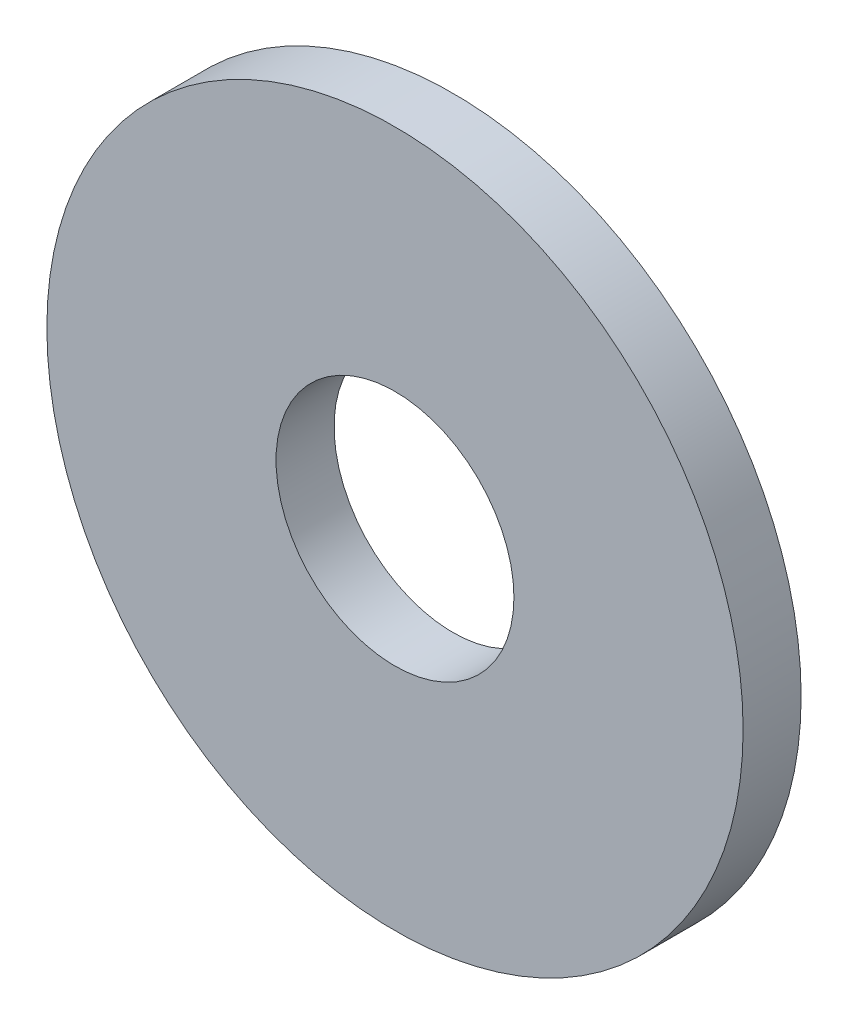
ISO-10303-21;
HEADER;
FILE_DESCRIPTION(('STEP AP214'),'2;1');
FILE_NAME('part.step','',(''),(''),'','','');
FILE_SCHEMA(('AUTOMOTIVE_DESIGN { 1 0 10303 214 1 1 1 1 }'));
ENDSEC;
DATA;
#1=APPLICATION_CONTEXT('core data for automotive mechanical design processes');
#2=APPLICATION_PROTOCOL_DEFINITION('international standard','automotive_design',2000,#1);
#3=PRODUCT_CONTEXT('',#1,'mechanical');
#4=PRODUCT('Part','Part','',(#3));
#5=PRODUCT_RELATED_PRODUCT_CATEGORY('part','',(#4));
#6=PRODUCT_DEFINITION_FORMATION('','',#4);
#7=PRODUCT_DEFINITION_CONTEXT('part definition',#1,'design');
#8=PRODUCT_DEFINITION('design','',#6,#7);
#9=PRODUCT_DEFINITION_SHAPE('','',#8);
#10=(LENGTH_UNIT() NAMED_UNIT(*) SI_UNIT(.MILLI.,.METRE.));
#11=(NAMED_UNIT(*) PLANE_ANGLE_UNIT() SI_UNIT($,.RADIAN.));
#12=(NAMED_UNIT(*) SI_UNIT($,.STERADIAN.) SOLID_ANGLE_UNIT());
#13=UNCERTAINTY_MEASURE_WITH_UNIT(LENGTH_MEASURE(1.E-05),#10,'distance_accuracy_value','');
#14=(GEOMETRIC_REPRESENTATION_CONTEXT(3) GLOBAL_UNCERTAINTY_ASSIGNED_CONTEXT((#13)) GLOBAL_UNIT_ASSIGNED_CONTEXT((#10,
#11,#12)) REPRESENTATION_CONTEXT('',''));
#15=CARTESIAN_POINT('',(0.,0.,0.));
#16=DIRECTION('',(0.,0.,1.));
#17=DIRECTION('',(1.,0.,0.));
#18=AXIS2_PLACEMENT_3D('',#15,#16,#17);
#19=CARTESIAN_POINT('',(0.,0.,0.999999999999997));
#20=DIRECTION('',(0.,0.,1.));
#21=DIRECTION('',(1.,0.,0.));
#22=AXIS2_PLACEMENT_3D('',#19,#20,#21);
#23=PLANE('',#22);
#24=CARTESIAN_POINT('',(0.,0.,0.999999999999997));
#25=DIRECTION('',(0.,0.,1.));
#26=DIRECTION('',(1.,0.,0.));
#27=AXIS2_PLACEMENT_3D('',#24,#25,#26);
#28=CIRCLE('',#27,6.);
#29=CARTESIAN_POINT('',(6.,0.,0.999999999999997));
#30=VERTEX_POINT('',#29);
#31=EDGE_CURVE('E10',#30,#30,#28,.T.);
#32=ORIENTED_EDGE('',*,*,#31,.T.);
#33=EDGE_LOOP('',(#32));
#34=FACE_BOUND('',#33,.T.);
#35=CARTESIAN_POINT('',(0.,0.,0.999999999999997));
#36=DIRECTION('',(0.,0.,1.));
#37=DIRECTION('',(1.,0.,0.));
#38=AXIS2_PLACEMENT_3D('',#35,#36,#37);
#39=CIRCLE('',#38,2.05);
#40=CARTESIAN_POINT('',(2.05,0.,0.999999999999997));
#41=VERTEX_POINT('',#40);
#42=EDGE_CURVE('E35',#41,#41,#39,.T.);
#43=ORIENTED_EDGE('',*,*,#42,.F.);
#44=EDGE_LOOP('',(#43));
#45=FACE_BOUND('',#44,.T.);
#46=ADVANCED_FACE('F24',(#34,#45),#23,.T.);
#47=CARTESIAN_POINT('',(0.,0.,0.));
#48=DIRECTION('',(0.,0.,1.));
#49=DIRECTION('',(1.,0.,0.));
#50=AXIS2_PLACEMENT_3D('',#47,#48,#49);
#51=PLANE('',#50);
#52=CARTESIAN_POINT('',(0.,0.,0.));
#53=DIRECTION('',(0.,0.,1.));
#54=DIRECTION('',(1.,0.,0.));
#55=AXIS2_PLACEMENT_3D('',#52,#53,#54);
#56=CIRCLE('',#55,6.);
#57=CARTESIAN_POINT('',(6.,0.,0.));
#58=VERTEX_POINT('',#57);
#59=EDGE_CURVE('E31',#58,#58,#56,.T.);
#60=ORIENTED_EDGE('',*,*,#59,.F.);
#61=EDGE_LOOP('',(#60));
#62=FACE_BOUND('',#61,.T.);
#63=CARTESIAN_POINT('',(0.,0.,0.));
#64=DIRECTION('',(0.,0.,1.));
#65=DIRECTION('',(1.,0.,0.));
#66=AXIS2_PLACEMENT_3D('',#63,#64,#65);
#67=CIRCLE('',#66,2.05);
#68=CARTESIAN_POINT('',(2.05,0.,0.));
#69=VERTEX_POINT('',#68);
#70=EDGE_CURVE('E39',#69,#69,#67,.T.);
#71=ORIENTED_EDGE('',*,*,#70,.T.);
#72=EDGE_LOOP('',(#71));
#73=FACE_BOUND('',#72,.T.);
#74=ADVANCED_FACE('F45',(#62,#73),#51,.F.);
#75=CARTESIAN_POINT('',(0.,0.,0.999999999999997));
#76=DIRECTION('',(0.,0.,-1.));
#77=DIRECTION('',(-1.,0.,0.));
#78=AXIS2_PLACEMENT_3D('',#75,#76,#77);
#79=CYLINDRICAL_SURFACE('',#78,6.);
#80=ORIENTED_EDGE('',*,*,#31,.F.);
#81=EDGE_LOOP('',(#80));
#82=FACE_BOUND('',#81,.T.);
#83=ORIENTED_EDGE('',*,*,#59,.T.);
#84=EDGE_LOOP('',(#83));
#85=FACE_BOUND('',#84,.T.);
#86=ADVANCED_FACE('F26',(#82,#85),#79,.T.);
#87=CARTESIAN_POINT('',(0.,0.,0.999999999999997));
#88=DIRECTION('',(0.,0.,-1.));
#89=DIRECTION('',(-1.,0.,0.));
#90=AXIS2_PLACEMENT_3D('',#87,#88,#89);
#91=CYLINDRICAL_SURFACE('',#90,2.05);
#92=ORIENTED_EDGE('',*,*,#42,.T.);
#93=EDGE_LOOP('',(#92));
#94=FACE_BOUND('',#93,.T.);
#95=ORIENTED_EDGE('',*,*,#70,.F.);
#96=EDGE_LOOP('',(#95));
#97=FACE_BOUND('',#96,.T.);
#98=ADVANCED_FACE('F47',(#94,#97),#91,.F.);
#99=CLOSED_SHELL('',(#46,#74,#86,#98));
#100=MANIFOLD_SOLID_BREP('B2',#99);
#101=ADVANCED_BREP_SHAPE_REPRESENTATION('',(#18,#100),#14);
#102=SHAPE_DEFINITION_REPRESENTATION(#9,#101);
ENDSEC;
END-ISO-10303-21;
